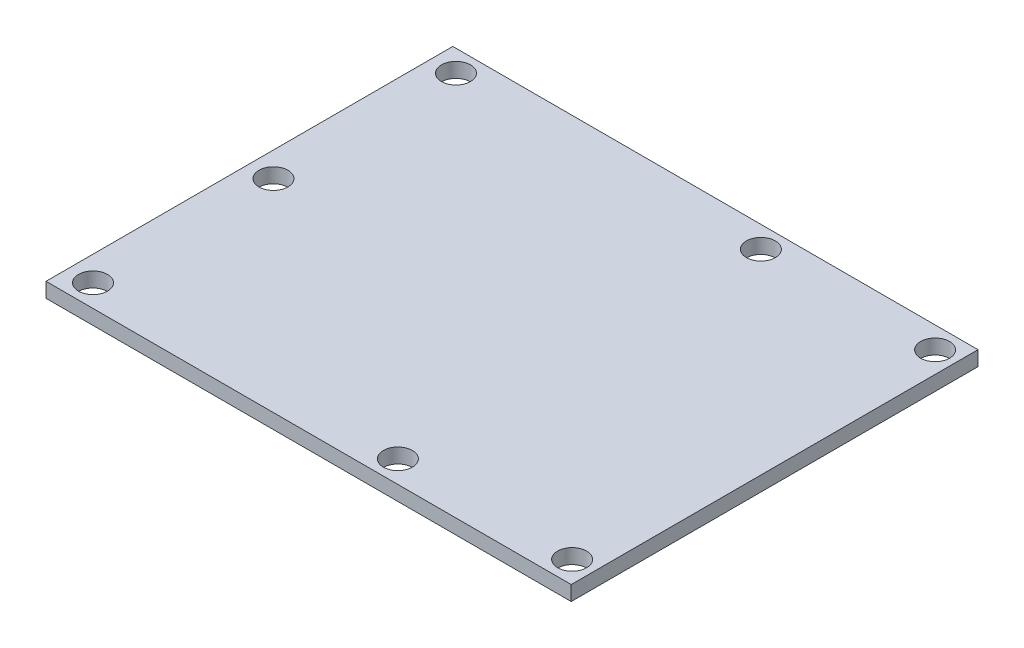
from build123d import *

# Parameters (mm, degrees)
SKETCH_2_W          = 71.16967226
SKETCH_2_H          = 55.121608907
EXTRUDE_1_DEPTH     = 2
SKETCH_9_R          = 1.96430419
CUT_EXTRUDE_2_DEPTH = 10


with BuildPart() as part:
    # Sketch 2 → Extrude 1 (new body)
    with BuildSketch(Plane(origin=(0, 0, 0), x_dir=(1, 0, 0), z_dir=(0, 1, 0))):
        with Locations((-13.257095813, 10.466128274)):
            Rectangle(SKETCH_2_W, SKETCH_2_H)
    extrude(amount=-EXTRUDE_1_DEPTH)

    # Sketch 9 → Cut-Extrude 2 (cut)
    with BuildSketch(Plane(origin=(0, 0, 0), x_dir=(1, 0, 0), z_dir=(0, 1, 0))):
        with Locations(Location((-45.48365576, 10.367079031, 0), (0, 0, 270))):
            Circle(SKETCH_9_R)
        with Locations(Location((-45.48365576, -14.085385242, 0), (0, 0, 270))):
            Circle(SKETCH_9_R)
        with Locations(Location((-4.167423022, -14.085385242, 0), (0, 0, 270))):
            Circle(SKETCH_9_R)
        with Locations(Location((19.441852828, -14.085385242, 0), (0, 0, 270))):
            Circle(SKETCH_9_R)
        with Locations(Location((19.441852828, 35.100606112, 0), (0, 0, 270))):
            Circle(SKETCH_9_R)
        with Locations(Location((-45.48365576, 35.100606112, 0), (0, 0, 270))):
            Circle(SKETCH_9_R)
        with Locations(Location((-4.167423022, 35.100606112, 0), (0, 0, 270))):
            Circle(SKETCH_9_R)
    extrude(amount=-CUT_EXTRUDE_2_DEPTH, mode=Mode.SUBTRACT)


solid = part.part
